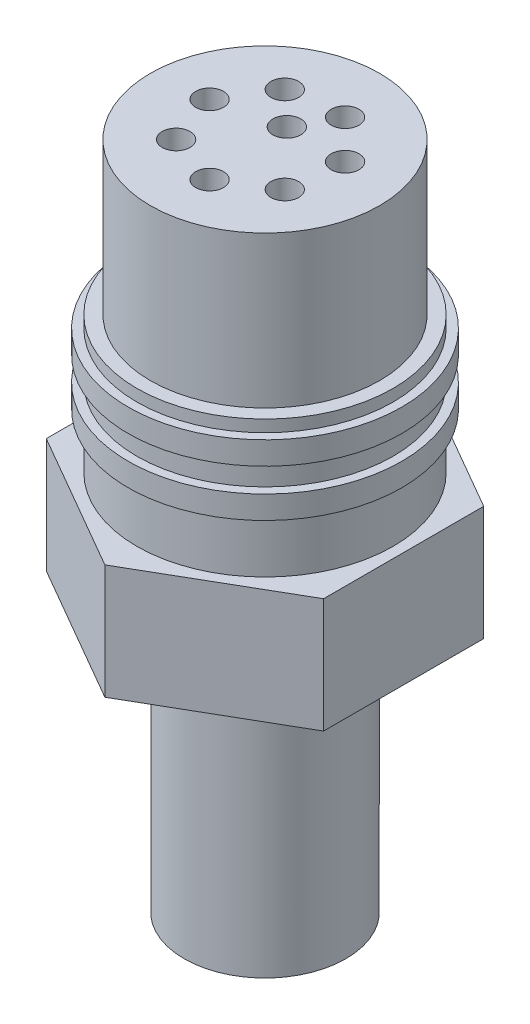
ISO-10303-21;
HEADER;
FILE_DESCRIPTION(('STEP AP214'),'2;1');
FILE_NAME('part.step','',(''),(''),'','','');
FILE_SCHEMA(('AUTOMOTIVE_DESIGN { 1 0 10303 214 1 1 1 1 }'));
ENDSEC;
DATA;
#1=APPLICATION_CONTEXT('core data for automotive mechanical design processes');
#2=APPLICATION_PROTOCOL_DEFINITION('international standard','automotive_design',2000,#1);
#3=PRODUCT_CONTEXT('',#1,'mechanical');
#4=PRODUCT('Part','Part','',(#3));
#5=PRODUCT_RELATED_PRODUCT_CATEGORY('part','',(#4));
#6=PRODUCT_DEFINITION_FORMATION('','',#4);
#7=PRODUCT_DEFINITION_CONTEXT('part definition',#1,'design');
#8=PRODUCT_DEFINITION('design','',#6,#7);
#9=PRODUCT_DEFINITION_SHAPE('','',#8);
#10=(LENGTH_UNIT() NAMED_UNIT(*) SI_UNIT(.MILLI.,.METRE.));
#11=(NAMED_UNIT(*) PLANE_ANGLE_UNIT() SI_UNIT($,.RADIAN.));
#12=(NAMED_UNIT(*) SI_UNIT($,.STERADIAN.) SOLID_ANGLE_UNIT());
#13=UNCERTAINTY_MEASURE_WITH_UNIT(LENGTH_MEASURE(1.E-05),#10,'distance_accuracy_value','');
#14=(GEOMETRIC_REPRESENTATION_CONTEXT(3) GLOBAL_UNCERTAINTY_ASSIGNED_CONTEXT((#13)) GLOBAL_UNIT_ASSIGNED_CONTEXT((#10,
#11,#12)) REPRESENTATION_CONTEXT('',''));
#15=CARTESIAN_POINT('',(0.,0.,0.));
#16=DIRECTION('',(0.,0.,1.));
#17=DIRECTION('',(1.,0.,0.));
#18=AXIS2_PLACEMENT_3D('',#15,#16,#17);
#19=CARTESIAN_POINT('',(9.52499999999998,7.874,-5.4992613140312));
#20=DIRECTION('',(-0.5,0.,0.866025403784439));
#21=DIRECTION('',(0.866025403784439,0.,0.5));
#22=AXIS2_PLACEMENT_3D('',#19,#20,#21);
#23=PLANE('',#22);
#24=DIRECTION('',(-0.866025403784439,0.,-0.5));
#25=VECTOR('',#24,1.);
#26=CARTESIAN_POINT('',(9.52499999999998,0.,-5.4992613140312));
#27=LINE('',#26,#25);
#28=CARTESIAN_POINT('',(9.52499999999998,0.,-5.4992613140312));
#29=VERTEX_POINT('',#28);
#30=CARTESIAN_POINT('',(0.,0.,-10.9985226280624));
#31=VERTEX_POINT('',#30);
#32=EDGE_CURVE('E122',#29,#31,#27,.T.);
#33=ORIENTED_EDGE('',*,*,#32,.T.);
#34=DIRECTION('',(0.,-1.,0.));
#35=VECTOR('',#34,1.);
#36=CARTESIAN_POINT('',(0.,7.874,-10.9985226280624));
#37=LINE('',#36,#35);
#38=CARTESIAN_POINT('',(0.,7.874,-10.9985226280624));
#39=VERTEX_POINT('',#38);
#40=EDGE_CURVE('E140',#39,#31,#37,.T.);
#41=ORIENTED_EDGE('',*,*,#40,.F.);
#42=DIRECTION('',(-0.866025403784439,0.,-0.5));
#43=VECTOR('',#42,1.);
#44=CARTESIAN_POINT('',(9.52499999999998,7.874,-5.4992613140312));
#45=LINE('',#44,#43);
#46=CARTESIAN_POINT('',(9.52499999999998,7.874,-5.4992613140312));
#47=VERTEX_POINT('',#46);
#48=EDGE_CURVE('E133',#47,#39,#45,.T.);
#49=ORIENTED_EDGE('',*,*,#48,.F.);
#50=DIRECTION('',(0.,-1.,0.));
#51=VECTOR('',#50,1.);
#52=CARTESIAN_POINT('',(9.52499999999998,7.874,-5.4992613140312));
#53=LINE('',#52,#51);
#54=EDGE_CURVE('E118',#47,#29,#53,.T.);
#55=ORIENTED_EDGE('',*,*,#54,.T.);
#56=EDGE_LOOP('',(#33,#41,#49,#55));
#57=FACE_BOUND('',#56,.T.);
#58=ADVANCED_FACE('F37',(#57),#23,.F.);
#59=CARTESIAN_POINT('',(0.,7.874,-10.9985226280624));
#60=DIRECTION('',(0.5,0.,0.866025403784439));
#61=DIRECTION('',(0.866025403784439,0.,-0.5));
#62=AXIS2_PLACEMENT_3D('',#59,#60,#61);
#63=PLANE('',#62);
#64=DIRECTION('',(-0.866025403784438,0.,0.5));
#65=VECTOR('',#64,1.);
#66=CARTESIAN_POINT('',(0.,0.,-10.9985226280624));
#67=LINE('',#66,#65);
#68=CARTESIAN_POINT('',(-9.52499999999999,0.,-5.49926131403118));
#69=VERTEX_POINT('',#68);
#70=EDGE_CURVE('E125',#31,#69,#67,.T.);
#71=ORIENTED_EDGE('',*,*,#70,.T.);
#72=DIRECTION('',(0.,-1.,0.));
#73=VECTOR('',#72,1.);
#74=CARTESIAN_POINT('',(-9.52499999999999,7.874,-5.49926131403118));
#75=LINE('',#74,#73);
#76=CARTESIAN_POINT('',(-9.52499999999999,7.874,-5.49926131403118));
#77=VERTEX_POINT('',#76);
#78=EDGE_CURVE('E137',#77,#69,#75,.T.);
#79=ORIENTED_EDGE('',*,*,#78,.F.);
#80=DIRECTION('',(-0.866025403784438,0.,0.5));
#81=VECTOR('',#80,1.);
#82=CARTESIAN_POINT('',(0.,7.874,-10.9985226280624));
#83=LINE('',#82,#81);
#84=EDGE_CURVE('E91',#39,#77,#83,.T.);
#85=ORIENTED_EDGE('',*,*,#84,.F.);
#86=ORIENTED_EDGE('',*,*,#40,.T.);
#87=EDGE_LOOP('',(#71,#79,#85,#86));
#88=FACE_BOUND('',#87,.T.);
#89=ADVANCED_FACE('F165',(#88),#63,.F.);
#90=CARTESIAN_POINT('',(-9.52499999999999,7.874,-5.49926131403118));
#91=DIRECTION('',(1.,0.,0.));
#92=DIRECTION('',(0.,0.,-1.));
#93=AXIS2_PLACEMENT_3D('',#90,#91,#92);
#94=PLANE('',#93);
#95=DIRECTION('',(0.,0.,1.));
#96=VECTOR('',#95,1.);
#97=CARTESIAN_POINT('',(-9.52499999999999,0.,-5.49926131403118));
#98=LINE('',#97,#96);
#99=CARTESIAN_POINT('',(-9.52499999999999,0.,5.49926131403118));
#100=VERTEX_POINT('',#99);
#101=EDGE_CURVE('E128',#69,#100,#98,.T.);
#102=ORIENTED_EDGE('',*,*,#101,.T.);
#103=DIRECTION('',(0.,-1.,0.));
#104=VECTOR('',#103,1.);
#105=CARTESIAN_POINT('',(-9.52499999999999,7.874,5.49926131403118));
#106=LINE('',#105,#104);
#107=CARTESIAN_POINT('',(-9.52499999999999,7.874,5.49926131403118));
#108=VERTEX_POINT('',#107);
#109=EDGE_CURVE('E113',#108,#100,#106,.T.);
#110=ORIENTED_EDGE('',*,*,#109,.F.);
#111=DIRECTION('',(0.,0.,1.));
#112=VECTOR('',#111,1.);
#113=CARTESIAN_POINT('',(-9.52499999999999,7.874,-5.49926131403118));
#114=LINE('',#113,#112);
#115=EDGE_CURVE('E104',#77,#108,#114,.T.);
#116=ORIENTED_EDGE('',*,*,#115,.F.);
#117=ORIENTED_EDGE('',*,*,#78,.T.);
#118=EDGE_LOOP('',(#102,#110,#116,#117));
#119=FACE_BOUND('',#118,.T.);
#120=ADVANCED_FACE('F168',(#119),#94,.F.);
#121=CARTESIAN_POINT('',(-9.52499999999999,7.874,5.49926131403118));
#122=DIRECTION('',(0.5,0.,-0.866025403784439));
#123=DIRECTION('',(-0.866025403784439,0.,-0.5));
#124=AXIS2_PLACEMENT_3D('',#121,#122,#123);
#125=PLANE('',#124);
#126=DIRECTION('',(0.866025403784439,0.,0.5));
#127=VECTOR('',#126,1.);
#128=CARTESIAN_POINT('',(-9.52499999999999,0.,5.49926131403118));
#129=LINE('',#128,#127);
#130=CARTESIAN_POINT('',(0.,0.,10.9985226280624));
#131=VERTEX_POINT('',#130);
#132=EDGE_CURVE('E112',#100,#131,#129,.T.);
#133=ORIENTED_EDGE('',*,*,#132,.T.);
#134=DIRECTION('',(0.,-1.,0.));
#135=VECTOR('',#134,1.);
#136=CARTESIAN_POINT('',(0.,7.874,10.9985226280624));
#137=LINE('',#136,#135);
#138=CARTESIAN_POINT('',(0.,7.874,10.9985226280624));
#139=VERTEX_POINT('',#138);
#140=EDGE_CURVE('E109',#139,#131,#137,.T.);
#141=ORIENTED_EDGE('',*,*,#140,.F.);
#142=DIRECTION('',(0.866025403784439,0.,0.5));
#143=VECTOR('',#142,1.);
#144=CARTESIAN_POINT('',(-9.52499999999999,7.874,5.49926131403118));
#145=LINE('',#144,#143);
#146=EDGE_CURVE('E98',#108,#139,#145,.T.);
#147=ORIENTED_EDGE('',*,*,#146,.F.);
#148=ORIENTED_EDGE('',*,*,#109,.T.);
#149=EDGE_LOOP('',(#133,#141,#147,#148));
#150=FACE_BOUND('',#149,.T.);
#151=ADVANCED_FACE('F110',(#150),#125,.F.);
#152=CARTESIAN_POINT('',(0.,7.874,10.9985226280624));
#153=DIRECTION('',(-0.5,0.,-0.866025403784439));
#154=DIRECTION('',(-0.866025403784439,0.,0.5));
#155=AXIS2_PLACEMENT_3D('',#152,#153,#154);
#156=PLANE('',#155);
#157=DIRECTION('',(0.866025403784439,0.,-0.5));
#158=VECTOR('',#157,1.);
#159=CARTESIAN_POINT('',(0.,0.,10.9985226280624));
#160=LINE('',#159,#158);
#161=CARTESIAN_POINT('',(9.52499999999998,0.,5.49926131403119));
#162=VERTEX_POINT('',#161);
#163=EDGE_CURVE('E76',#131,#162,#160,.T.);
#164=ORIENTED_EDGE('',*,*,#163,.T.);
#165=DIRECTION('',(0.,-1.,0.));
#166=VECTOR('',#165,1.);
#167=CARTESIAN_POINT('',(9.52499999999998,7.874,5.49926131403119));
#168=LINE('',#167,#166);
#169=CARTESIAN_POINT('',(9.52499999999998,7.874,5.49926131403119));
#170=VERTEX_POINT('',#169);
#171=EDGE_CURVE('E114',#170,#162,#168,.T.);
#172=ORIENTED_EDGE('',*,*,#171,.F.);
#173=DIRECTION('',(0.866025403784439,0.,-0.5));
#174=VECTOR('',#173,1.);
#175=CARTESIAN_POINT('',(0.,7.874,10.9985226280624));
#176=LINE('',#175,#174);
#177=EDGE_CURVE('E102',#139,#170,#176,.T.);
#178=ORIENTED_EDGE('',*,*,#177,.F.);
#179=ORIENTED_EDGE('',*,*,#140,.T.);
#180=EDGE_LOOP('',(#164,#172,#178,#179));
#181=FACE_BOUND('',#180,.T.);
#182=ADVANCED_FACE('F116',(#181),#156,.F.);
#183=CARTESIAN_POINT('',(9.52499999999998,7.874,5.49926131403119));
#184=DIRECTION('',(-1.,0.,0.));
#185=DIRECTION('',(0.,0.,1.));
#186=AXIS2_PLACEMENT_3D('',#183,#184,#185);
#187=PLANE('',#186);
#188=DIRECTION('',(0.,0.,-1.));
#189=VECTOR('',#188,1.);
#190=CARTESIAN_POINT('',(9.52499999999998,0.,5.49926131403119));
#191=LINE('',#190,#189);
#192=EDGE_CURVE('E82',#162,#29,#191,.T.);
#193=ORIENTED_EDGE('',*,*,#192,.T.);
#194=ORIENTED_EDGE('',*,*,#54,.F.);
#195=DIRECTION('',(0.,0.,-1.));
#196=VECTOR('',#195,1.);
#197=CARTESIAN_POINT('',(9.52499999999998,7.874,5.49926131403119));
#198=LINE('',#197,#196);
#199=EDGE_CURVE('E53',#170,#47,#198,.T.);
#200=ORIENTED_EDGE('',*,*,#199,.F.);
#201=ORIENTED_EDGE('',*,*,#171,.T.);
#202=EDGE_LOOP('',(#193,#194,#200,#201));
#203=FACE_BOUND('',#202,.T.);
#204=ADVANCED_FACE('F172',(#203),#187,.F.);
#205=CARTESIAN_POINT('',(-9.52499999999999,7.874,-16.4977839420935));
#206=DIRECTION('',(0.,1.,0.));
#207=DIRECTION('',(0.,0.,1.));
#208=AXIS2_PLACEMENT_3D('',#205,#206,#207);
#209=PLANE('',#208);
#210=CARTESIAN_POINT('',(0.,7.874,0.));
#211=DIRECTION('',(0.,1.,0.));
#212=DIRECTION('',(-1.,0.,0.));
#213=AXIS2_PLACEMENT_3D('',#210,#211,#212);
#214=CIRCLE('',#213,8.8011);
#215=CARTESIAN_POINT('',(-8.8011,7.874,0.));
#216=VERTEX_POINT('',#215);
#217=EDGE_CURVE('E574',#216,#216,#214,.T.);
#218=ORIENTED_EDGE('',*,*,#217,.F.);
#219=EDGE_LOOP('',(#218));
#220=FACE_BOUND('',#219,.T.);
#221=ORIENTED_EDGE('',*,*,#48,.T.);
#222=ORIENTED_EDGE('',*,*,#84,.T.);
#223=ORIENTED_EDGE('',*,*,#115,.T.);
#224=ORIENTED_EDGE('',*,*,#146,.T.);
#225=ORIENTED_EDGE('',*,*,#177,.T.);
#226=ORIENTED_EDGE('',*,*,#199,.T.);
#227=EDGE_LOOP('',(#221,#222,#223,#224,#225,#226));
#228=FACE_BOUND('',#227,.T.);
#229=ADVANCED_FACE('F100',(#220,#228),#209,.T.);
#230=CARTESIAN_POINT('',(-9.52499999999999,0.,-16.4977839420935));
#231=DIRECTION('',(0.,1.,0.));
#232=DIRECTION('',(0.,0.,1.));
#233=AXIS2_PLACEMENT_3D('',#230,#231,#232);
#234=PLANE('',#233);
#235=CARTESIAN_POINT('',(0.,0.,0.));
#236=DIRECTION('',(0.,1.,0.));
#237=DIRECTION('',(0.,0.,1.));
#238=AXIS2_PLACEMENT_3D('',#235,#236,#237);
#239=CIRCLE('',#238,5.55625);
#240=CARTESIAN_POINT('',(0.,0.,5.55625));
#241=VERTEX_POINT('',#240);
#242=EDGE_CURVE('E11',#241,#241,#239,.F.);
#243=ORIENTED_EDGE('',*,*,#242,.F.);
#244=EDGE_LOOP('',(#243));
#245=FACE_BOUND('',#244,.T.);
#246=ORIENTED_EDGE('',*,*,#32,.F.);
#247=ORIENTED_EDGE('',*,*,#192,.F.);
#248=ORIENTED_EDGE('',*,*,#163,.F.);
#249=ORIENTED_EDGE('',*,*,#132,.F.);
#250=ORIENTED_EDGE('',*,*,#101,.F.);
#251=ORIENTED_EDGE('',*,*,#70,.F.);
#252=EDGE_LOOP('',(#246,#247,#248,#249,#250,#251));
#253=FACE_BOUND('',#252,.T.);
#254=ADVANCED_FACE('F150',(#245,#253),#234,.F.);
#255=CARTESIAN_POINT('',(8.8011,17.272,0.));
#256=DIRECTION('',(0.,-1.,0.));
#257=DIRECTION('',(1.,0.,0.));
#258=AXIS2_PLACEMENT_3D('',#255,#256,#257);
#259=PLANE('',#258);
#260=CARTESIAN_POINT('',(0.,17.272,0.));
#261=DIRECTION('',(0.,-1.,0.));
#262=DIRECTION('',(1.,0.,0.));
#263=AXIS2_PLACEMENT_3D('',#260,#261,#262);
#264=CIRCLE('',#263,7.875);
#265=CARTESIAN_POINT('',(7.875,17.272,0.));
#266=VERTEX_POINT('',#265);
#267=EDGE_CURVE('E45',#266,#266,#264,.F.);
#268=ORIENTED_EDGE('',*,*,#267,.F.);
#269=EDGE_LOOP('',(#268));
#270=FACE_BOUND('',#269,.T.);
#271=CARTESIAN_POINT('',(0.,17.272,0.));
#272=DIRECTION('',(0.,1.,0.));
#273=DIRECTION('',(-1.,0.,0.));
#274=AXIS2_PLACEMENT_3D('',#271,#272,#273);
#275=CIRCLE('',#274,8.8011);
#276=CARTESIAN_POINT('',(-8.8011,17.272,0.));
#277=VERTEX_POINT('',#276);
#278=EDGE_CURVE('E126',#277,#277,#275,.T.);
#279=ORIENTED_EDGE('',*,*,#278,.T.);
#280=EDGE_LOOP('',(#279));
#281=FACE_BOUND('',#280,.T.);
#282=ADVANCED_FACE('F146',(#270,#281),#259,.F.);
#283=CARTESIAN_POINT('',(0.,0.,0.));
#284=DIRECTION('',(0.,1.,0.));
#285=DIRECTION('',(-1.,0.,0.));
#286=AXIS2_PLACEMENT_3D('',#283,#284,#285);
#287=CYLINDRICAL_SURFACE('',#286,8.8011);
#288=ORIENTED_EDGE('',*,*,#278,.F.);
#289=EDGE_LOOP('',(#288));
#290=FACE_BOUND('',#289,.T.);
#291=CARTESIAN_POINT('',(0.,16.4592,0.));
#292=DIRECTION('',(0.,1.,0.));
#293=DIRECTION('',(-1.,0.,0.));
#294=AXIS2_PLACEMENT_3D('',#291,#292,#293);
#295=CIRCLE('',#294,8.8011);
#296=CARTESIAN_POINT('',(-8.8011,16.4592,0.));
#297=VERTEX_POINT('',#296);
#298=EDGE_CURVE('E155',#297,#297,#295,.T.);
#299=ORIENTED_EDGE('',*,*,#298,.T.);
#300=EDGE_LOOP('',(#299));
#301=FACE_BOUND('',#300,.T.);
#302=ADVANCED_FACE('F149',(#290,#301),#287,.T.);
#303=CARTESIAN_POINT('',(9.398,16.4592,0.));
#304=DIRECTION('',(0.,-1.,0.));
#305=DIRECTION('',(1.,0.,0.));
#306=AXIS2_PLACEMENT_3D('',#303,#304,#305);
#307=PLANE('',#306);
#308=ORIENTED_EDGE('',*,*,#298,.F.);
#309=EDGE_LOOP('',(#308));
#310=FACE_BOUND('',#309,.T.);
#311=CARTESIAN_POINT('',(0.,16.4592,0.));
#312=DIRECTION('',(0.,1.,0.));
#313=DIRECTION('',(-1.,0.,0.));
#314=AXIS2_PLACEMENT_3D('',#311,#312,#313);
#315=CIRCLE('',#314,9.398);
#316=CARTESIAN_POINT('',(-9.398,16.4592,0.));
#317=VERTEX_POINT('',#316);
#318=EDGE_CURVE('E158',#317,#317,#315,.T.);
#319=ORIENTED_EDGE('',*,*,#318,.T.);
#320=EDGE_LOOP('',(#319));
#321=FACE_BOUND('',#320,.T.);
#322=ADVANCED_FACE('F222',(#310,#321),#307,.F.);
#323=CARTESIAN_POINT('',(0.,0.,0.));
#324=DIRECTION('',(0.,1.,0.));
#325=DIRECTION('',(-1.,0.,0.));
#326=AXIS2_PLACEMENT_3D('',#323,#324,#325);
#327=CYLINDRICAL_SURFACE('',#326,9.398);
#328=ORIENTED_EDGE('',*,*,#318,.F.);
#329=EDGE_LOOP('',(#328));
#330=FACE_BOUND('',#329,.T.);
#331=CARTESIAN_POINT('',(0.,14.8844,0.));
#332=DIRECTION('',(0.,1.,0.));
#333=DIRECTION('',(-1.,0.,0.));
#334=AXIS2_PLACEMENT_3D('',#331,#332,#333);
#335=CIRCLE('',#334,9.398);
#336=CARTESIAN_POINT('',(-9.398,14.8844,0.));
#337=VERTEX_POINT('',#336);
#338=EDGE_CURVE('E592',#337,#337,#335,.T.);
#339=ORIENTED_EDGE('',*,*,#338,.T.);
#340=EDGE_LOOP('',(#339));
#341=FACE_BOUND('',#340,.T.);
#342=ADVANCED_FACE('F232',(#330,#341),#327,.T.);
#343=CARTESIAN_POINT('',(8.8011,14.8844,0.));
#344=DIRECTION('',(0.,1.,0.));
#345=DIRECTION('',(-1.,0.,0.));
#346=AXIS2_PLACEMENT_3D('',#343,#344,#345);
#347=PLANE('',#346);
#348=ORIENTED_EDGE('',*,*,#338,.F.);
#349=EDGE_LOOP('',(#348));
#350=FACE_BOUND('',#349,.T.);
#351=CARTESIAN_POINT('',(0.,14.8844,0.));
#352=DIRECTION('',(0.,1.,0.));
#353=DIRECTION('',(-1.,0.,0.));
#354=AXIS2_PLACEMENT_3D('',#351,#352,#353);
#355=CIRCLE('',#354,8.8011);
#356=CARTESIAN_POINT('',(-8.8011,14.8844,0.));
#357=VERTEX_POINT('',#356);
#358=EDGE_CURVE('E589',#357,#357,#355,.T.);
#359=ORIENTED_EDGE('',*,*,#358,.T.);
#360=EDGE_LOOP('',(#359));
#361=FACE_BOUND('',#360,.T.);
#362=ADVANCED_FACE('F242',(#350,#361),#347,.F.);
#363=CARTESIAN_POINT('',(0.,0.,0.));
#364=DIRECTION('',(0.,1.,0.));
#365=DIRECTION('',(-1.,0.,0.));
#366=AXIS2_PLACEMENT_3D('',#363,#364,#365);
#367=CYLINDRICAL_SURFACE('',#366,8.8011);
#368=ORIENTED_EDGE('',*,*,#358,.F.);
#369=EDGE_LOOP('',(#368));
#370=FACE_BOUND('',#369,.T.);
#371=CARTESIAN_POINT('',(0.,13.2334,0.));
#372=DIRECTION('',(0.,1.,0.));
#373=DIRECTION('',(-1.,0.,0.));
#374=AXIS2_PLACEMENT_3D('',#371,#372,#373);
#375=CIRCLE('',#374,8.8011);
#376=CARTESIAN_POINT('',(-8.8011,13.2334,0.));
#377=VERTEX_POINT('',#376);
#378=EDGE_CURVE('E586',#377,#377,#375,.T.);
#379=ORIENTED_EDGE('',*,*,#378,.T.);
#380=EDGE_LOOP('',(#379));
#381=FACE_BOUND('',#380,.T.);
#382=ADVANCED_FACE('F252',(#370,#381),#367,.T.);
#383=CARTESIAN_POINT('',(9.398,13.2334,0.));
#384=DIRECTION('',(0.,-1.,0.));
#385=DIRECTION('',(1.,0.,0.));
#386=AXIS2_PLACEMENT_3D('',#383,#384,#385);
#387=PLANE('',#386);
#388=ORIENTED_EDGE('',*,*,#378,.F.);
#389=EDGE_LOOP('',(#388));
#390=FACE_BOUND('',#389,.T.);
#391=CARTESIAN_POINT('',(0.,13.2334,0.));
#392=DIRECTION('',(0.,1.,0.));
#393=DIRECTION('',(-1.,0.,0.));
#394=AXIS2_PLACEMENT_3D('',#391,#392,#393);
#395=CIRCLE('',#394,9.398);
#396=CARTESIAN_POINT('',(-9.398,13.2334,0.));
#397=VERTEX_POINT('',#396);
#398=EDGE_CURVE('E583',#397,#397,#395,.T.);
#399=ORIENTED_EDGE('',*,*,#398,.T.);
#400=EDGE_LOOP('',(#399));
#401=FACE_BOUND('',#400,.T.);
#402=ADVANCED_FACE('F262',(#390,#401),#387,.F.);
#403=CARTESIAN_POINT('',(0.,0.,0.));
#404=DIRECTION('',(0.,1.,0.));
#405=DIRECTION('',(-1.,0.,0.));
#406=AXIS2_PLACEMENT_3D('',#403,#404,#405);
#407=CYLINDRICAL_SURFACE('',#406,9.398);
#408=ORIENTED_EDGE('',*,*,#398,.F.);
#409=EDGE_LOOP('',(#408));
#410=FACE_BOUND('',#409,.T.);
#411=CARTESIAN_POINT('',(0.,11.6586,0.));
#412=DIRECTION('',(0.,1.,0.));
#413=DIRECTION('',(-1.,0.,0.));
#414=AXIS2_PLACEMENT_3D('',#411,#412,#413);
#415=CIRCLE('',#414,9.398);
#416=CARTESIAN_POINT('',(-9.398,11.6586,0.));
#417=VERTEX_POINT('',#416);
#418=EDGE_CURVE('E580',#417,#417,#415,.T.);
#419=ORIENTED_EDGE('',*,*,#418,.T.);
#420=EDGE_LOOP('',(#419));
#421=FACE_BOUND('',#420,.T.);
#422=ADVANCED_FACE('F272',(#410,#421),#407,.T.);
#423=CARTESIAN_POINT('',(8.80109999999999,11.6586,0.));
#424=DIRECTION('',(0.,1.,0.));
#425=DIRECTION('',(-1.,0.,0.));
#426=AXIS2_PLACEMENT_3D('',#423,#424,#425);
#427=PLANE('',#426);
#428=ORIENTED_EDGE('',*,*,#418,.F.);
#429=EDGE_LOOP('',(#428));
#430=FACE_BOUND('',#429,.T.);
#431=CARTESIAN_POINT('',(0.,11.6586,0.));
#432=DIRECTION('',(0.,1.,0.));
#433=DIRECTION('',(-1.,0.,0.));
#434=AXIS2_PLACEMENT_3D('',#431,#432,#433);
#435=CIRCLE('',#434,8.8011);
#436=CARTESIAN_POINT('',(-8.8011,11.6586,0.));
#437=VERTEX_POINT('',#436);
#438=EDGE_CURVE('E577',#437,#437,#435,.T.);
#439=ORIENTED_EDGE('',*,*,#438,.T.);
#440=EDGE_LOOP('',(#439));
#441=FACE_BOUND('',#440,.T.);
#442=ADVANCED_FACE('F282',(#430,#441),#427,.F.);
#443=CARTESIAN_POINT('',(0.,0.,0.));
#444=DIRECTION('',(0.,1.,0.));
#445=DIRECTION('',(-1.,0.,0.));
#446=AXIS2_PLACEMENT_3D('',#443,#444,#445);
#447=CYLINDRICAL_SURFACE('',#446,8.8011);
#448=ORIENTED_EDGE('',*,*,#438,.F.);
#449=EDGE_LOOP('',(#448));
#450=FACE_BOUND('',#449,.T.);
#451=ORIENTED_EDGE('',*,*,#217,.T.);
#452=EDGE_LOOP('',(#451));
#453=FACE_BOUND('',#452,.T.);
#454=ADVANCED_FACE('F292',(#450,#453),#447,.T.);
#455=CARTESIAN_POINT('',(0.,27.682,0.));
#456=DIRECTION('',(0.,-1.,0.));
#457=DIRECTION('',(1.,0.,0.));
#458=AXIS2_PLACEMENT_3D('',#455,#456,#457);
#459=CYLINDRICAL_SURFACE('',#458,7.875);
#460=CARTESIAN_POINT('',(0.,27.682,0.));
#461=DIRECTION('',(0.,1.,0.));
#462=DIRECTION('',(-1.,0.,0.));
#463=AXIS2_PLACEMENT_3D('',#460,#461,#462);
#464=CIRCLE('',#463,7.875);
#465=CARTESIAN_POINT('',(-7.875,27.682,0.));
#466=VERTEX_POINT('',#465);
#467=EDGE_CURVE('E571',#466,#466,#464,.T.);
#468=ORIENTED_EDGE('',*,*,#467,.F.);
#469=EDGE_LOOP('',(#468));
#470=FACE_BOUND('',#469,.T.);
#471=ORIENTED_EDGE('',*,*,#267,.T.);
#472=EDGE_LOOP('',(#471));
#473=FACE_BOUND('',#472,.T.);
#474=ADVANCED_FACE('F144',(#470,#473),#459,.T.);
#475=CARTESIAN_POINT('',(0.,27.682,0.));
#476=DIRECTION('',(0.,1.,0.));
#477=DIRECTION('',(-1.,0.,0.));
#478=AXIS2_PLACEMENT_3D('',#475,#476,#477);
#479=PLANE('',#478);
#480=CARTESIAN_POINT('',(0.,27.682,-1.5));
#481=DIRECTION('',(0.,1.,0.));
#482=DIRECTION('',(-1.,0.,0.));
#483=AXIS2_PLACEMENT_3D('',#480,#481,#482);
#484=CIRCLE('',#483,0.955);
#485=CARTESIAN_POINT('',(-0.955000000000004,27.682,-1.5));
#486=VERTEX_POINT('',#485);
#487=EDGE_CURVE('E521',#486,#486,#484,.T.);
#488=ORIENTED_EDGE('',*,*,#487,.F.);
#489=EDGE_LOOP('',(#488));
#490=FACE_BOUND('',#489,.T.);
#491=CARTESIAN_POINT('',(0.483462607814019,27.682,4.29084932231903));
#492=DIRECTION('',(0.,1.,0.));
#493=DIRECTION('',(-0.623489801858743,0.,0.781831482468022));
#494=AXIS2_PLACEMENT_3D('',#491,#492,#493);
#495=CIRCLE('',#494,0.955);
#496=CARTESIAN_POINT('',(-0.11197015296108,27.682,5.03749838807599));
#497=VERTEX_POINT('',#496);
#498=EDGE_CURVE('E529',#497,#497,#495,.T.);
#499=ORIENTED_EDGE('',*,*,#498,.F.);
#500=EDGE_LOOP('',(#499));
#501=FACE_BOUND('',#500,.T.);
#502=CARTESIAN_POINT('',(3.6561550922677,27.682,2.29731450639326));
#503=DIRECTION('',(0.,1.,0.));
#504=DIRECTION('',(0.222520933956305,0.,0.974927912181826));
#505=AXIS2_PLACEMENT_3D('',#502,#503,#504);
#506=CIRCLE('',#505,0.955);
#507=CARTESIAN_POINT('',(3.86866258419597,27.682,3.22837066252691));
#508=VERTEX_POINT('',#507);
#509=EDGE_CURVE('E535',#508,#508,#506,.T.);
#510=ORIENTED_EDGE('',*,*,#509,.F.);
#511=EDGE_LOOP('',(#510));
#512=FACE_BOUND('',#511,.T.);
#513=CARTESIAN_POINT('',(4.07568822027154,27.682,-1.42614498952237));
#514=DIRECTION('',(0.,1.,0.));
#515=DIRECTION('',(0.900968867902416,0.,0.433883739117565));
#516=AXIS2_PLACEMENT_3D('',#513,#514,#515);
#517=CIRCLE('',#516,0.955);
#518=CARTESIAN_POINT('',(4.93611348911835,27.682,-1.0117860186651));
#519=VERTEX_POINT('',#518);
#520=EDGE_CURVE('E541',#519,#519,#517,.T.);
#521=ORIENTED_EDGE('',*,*,#520,.F.);
#522=EDGE_LOOP('',(#521));
#523=FACE_BOUND('',#522,.T.);
#524=CARTESIAN_POINT('',(1.42614498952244,27.682,-4.07568822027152));
#525=DIRECTION('',(0.,1.,0.));
#526=DIRECTION('',(0.900968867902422,0.,-0.433883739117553));
#527=AXIS2_PLACEMENT_3D('',#524,#525,#526);
#528=CIRCLE('',#527,0.955);
#529=CARTESIAN_POINT('',(2.28657025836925,27.682,-4.49004719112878));
#530=VERTEX_POINT('',#529);
#531=EDGE_CURVE('E547',#530,#530,#528,.T.);
#532=ORIENTED_EDGE('',*,*,#531,.F.);
#533=EDGE_LOOP('',(#532));
#534=FACE_BOUND('',#533,.T.);
#535=CARTESIAN_POINT('',(-2.29731450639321,27.682,-3.65615509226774));
#536=DIRECTION('',(0.,1.,0.));
#537=DIRECTION('',(0.222520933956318,0.,-0.974927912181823));
#538=AXIS2_PLACEMENT_3D('',#535,#536,#537);
#539=CIRCLE('',#538,0.955);
#540=CARTESIAN_POINT('',(-2.08480701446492,27.682,-4.58721124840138));
#541=VERTEX_POINT('',#540);
#542=EDGE_CURVE('E553',#541,#541,#539,.T.);
#543=ORIENTED_EDGE('',*,*,#542,.F.);
#544=EDGE_LOOP('',(#543));
#545=FACE_BOUND('',#544,.T.);
#546=CARTESIAN_POINT('',(-4.29084932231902,27.682,-0.4834626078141));
#547=DIRECTION('',(0.,1.,0.));
#548=DIRECTION('',(-0.623489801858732,0.,-0.781831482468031));
#549=AXIS2_PLACEMENT_3D('',#546,#547,#548);
#550=CIRCLE('',#549,0.955);
#551=CARTESIAN_POINT('',(-4.88628208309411,27.682,-1.23011167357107));
#552=VERTEX_POINT('',#551);
#553=EDGE_CURVE('E559',#552,#552,#550,.T.);
#554=ORIENTED_EDGE('',*,*,#553,.F.);
#555=EDGE_LOOP('',(#554));
#556=FACE_BOUND('',#555,.T.);
#557=CARTESIAN_POINT('',(-3.05328708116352,27.682,3.05328708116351));
#558=DIRECTION('',(0.,1.,0.));
#559=DIRECTION('',(-1.,0.,0.));
#560=AXIS2_PLACEMENT_3D('',#557,#558,#559);
#561=CIRCLE('',#560,0.955);
#562=CARTESIAN_POINT('',(-4.00828708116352,27.682,3.05328708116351));
#563=VERTEX_POINT('',#562);
#564=EDGE_CURVE('E565',#563,#563,#561,.T.);
#565=ORIENTED_EDGE('',*,*,#564,.F.);
#566=EDGE_LOOP('',(#565));
#567=FACE_BOUND('',#566,.T.);
#568=ORIENTED_EDGE('',*,*,#467,.T.);
#569=EDGE_LOOP('',(#568));
#570=FACE_BOUND('',#569,.T.);
#571=ADVANCED_FACE('F316',(#490,#501,#512,#523,#534,#545,#556,#567,#570),#479,.T.);
#572=CARTESIAN_POINT('',(8.8011,17.272,0.));
#573=DIRECTION('',(0.,-1.,0.));
#574=DIRECTION('',(1.,0.,0.));
#575=AXIS2_PLACEMENT_3D('',#572,#573,#574);
#576=PLANE('',#575);
#577=CARTESIAN_POINT('',(-3.05328708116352,17.272,3.05328708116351));
#578=DIRECTION('',(0.,-1.,0.));
#579=DIRECTION('',(1.,0.,0.));
#580=AXIS2_PLACEMENT_3D('',#577,#578,#579);
#581=CIRCLE('',#580,0.955);
#582=CARTESIAN_POINT('',(-2.09828708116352,17.272,3.05328708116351));
#583=VERTEX_POINT('',#582);
#584=EDGE_CURVE('E568',#583,#583,#581,.F.);
#585=ORIENTED_EDGE('',*,*,#584,.T.);
#586=EDGE_LOOP('',(#585));
#587=FACE_BOUND('',#586,.T.);
#588=ADVANCED_FACE('F324',(#587),#576,.F.);
#589=CARTESIAN_POINT('',(-3.05328708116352,14.5708520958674,3.05328708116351));
#590=DIRECTION('',(0.,1.,0.));
#591=DIRECTION('',(-1.,0.,0.));
#592=AXIS2_PLACEMENT_3D('',#589,#590,#591);
#593=CYLINDRICAL_SURFACE('',#592,0.955);
#594=ORIENTED_EDGE('',*,*,#564,.T.);
#595=EDGE_LOOP('',(#594));
#596=FACE_BOUND('',#595,.T.);
#597=ORIENTED_EDGE('',*,*,#584,.F.);
#598=EDGE_LOOP('',(#597));
#599=FACE_BOUND('',#598,.T.);
#600=ADVANCED_FACE('F329',(#596,#599),#593,.F.);
#601=CARTESIAN_POINT('',(8.8011,17.272,0.));
#602=DIRECTION('',(0.,-1.,0.));
#603=DIRECTION('',(1.,0.,0.));
#604=AXIS2_PLACEMENT_3D('',#601,#602,#603);
#605=PLANE('',#604);
#606=CARTESIAN_POINT('',(-4.29084932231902,17.272,-0.4834626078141));
#607=DIRECTION('',(0.,-1.,0.));
#608=DIRECTION('',(1.,0.,0.));
#609=AXIS2_PLACEMENT_3D('',#606,#607,#608);
#610=CIRCLE('',#609,0.955);
#611=CARTESIAN_POINT('',(-3.33584932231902,17.272,-0.4834626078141));
#612=VERTEX_POINT('',#611);
#613=EDGE_CURVE('E562',#612,#612,#610,.F.);
#614=ORIENTED_EDGE('',*,*,#613,.T.);
#615=EDGE_LOOP('',(#614));
#616=FACE_BOUND('',#615,.T.);
#617=ADVANCED_FACE('F339',(#616),#605,.F.);
#618=CARTESIAN_POINT('',(-4.29084932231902,14.5708520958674,-0.4834626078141));
#619=DIRECTION('',(0.,1.,0.));
#620=DIRECTION('',(-1.,0.,0.));
#621=AXIS2_PLACEMENT_3D('',#618,#619,#620);
#622=CYLINDRICAL_SURFACE('',#621,0.955);
#623=ORIENTED_EDGE('',*,*,#553,.T.);
#624=EDGE_LOOP('',(#623));
#625=FACE_BOUND('',#624,.T.);
#626=ORIENTED_EDGE('',*,*,#613,.F.);
#627=EDGE_LOOP('',(#626));
#628=FACE_BOUND('',#627,.T.);
#629=ADVANCED_FACE('F349',(#625,#628),#622,.F.);
#630=CARTESIAN_POINT('',(8.8011,17.272,0.));
#631=DIRECTION('',(0.,-1.,0.));
#632=DIRECTION('',(1.,0.,0.));
#633=AXIS2_PLACEMENT_3D('',#630,#631,#632);
#634=PLANE('',#633);
#635=CARTESIAN_POINT('',(-2.2973145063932,17.272,-3.65615509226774));
#636=DIRECTION('',(0.,-1.,0.));
#637=DIRECTION('',(1.,0.,0.));
#638=AXIS2_PLACEMENT_3D('',#635,#636,#637);
#639=CIRCLE('',#638,0.955);
#640=CARTESIAN_POINT('',(-1.3423145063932,17.272,-3.65615509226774));
#641=VERTEX_POINT('',#640);
#642=EDGE_CURVE('E556',#641,#641,#639,.F.);
#643=ORIENTED_EDGE('',*,*,#642,.T.);
#644=EDGE_LOOP('',(#643));
#645=FACE_BOUND('',#644,.T.);
#646=ADVANCED_FACE('F359',(#645),#634,.F.);
#647=CARTESIAN_POINT('',(-2.2973145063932,14.5708520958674,-3.65615509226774));
#648=DIRECTION('',(0.,1.,0.));
#649=DIRECTION('',(-1.,0.,0.));
#650=AXIS2_PLACEMENT_3D('',#647,#648,#649);
#651=CYLINDRICAL_SURFACE('',#650,0.955);
#652=ORIENTED_EDGE('',*,*,#542,.T.);
#653=EDGE_LOOP('',(#652));
#654=FACE_BOUND('',#653,.T.);
#655=ORIENTED_EDGE('',*,*,#642,.F.);
#656=EDGE_LOOP('',(#655));
#657=FACE_BOUND('',#656,.T.);
#658=ADVANCED_FACE('F369',(#654,#657),#651,.F.);
#659=CARTESIAN_POINT('',(8.8011,17.272,0.));
#660=DIRECTION('',(0.,-1.,0.));
#661=DIRECTION('',(1.,0.,0.));
#662=AXIS2_PLACEMENT_3D('',#659,#660,#661);
#663=PLANE('',#662);
#664=CARTESIAN_POINT('',(1.42614498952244,17.272,-4.07568822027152));
#665=DIRECTION('',(0.,-1.,0.));
#666=DIRECTION('',(1.,0.,0.));
#667=AXIS2_PLACEMENT_3D('',#664,#665,#666);
#668=CIRCLE('',#667,0.955);
#669=CARTESIAN_POINT('',(2.38114498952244,17.272,-4.07568822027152));
#670=VERTEX_POINT('',#669);
#671=EDGE_CURVE('E550',#670,#670,#668,.F.);
#672=ORIENTED_EDGE('',*,*,#671,.T.);
#673=EDGE_LOOP('',(#672));
#674=FACE_BOUND('',#673,.T.);
#675=ADVANCED_FACE('F379',(#674),#663,.F.);
#676=CARTESIAN_POINT('',(1.42614498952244,14.5708520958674,-4.07568822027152));
#677=DIRECTION('',(0.,1.,0.));
#678=DIRECTION('',(-1.,0.,0.));
#679=AXIS2_PLACEMENT_3D('',#676,#677,#678);
#680=CYLINDRICAL_SURFACE('',#679,0.955);
#681=ORIENTED_EDGE('',*,*,#531,.T.);
#682=EDGE_LOOP('',(#681));
#683=FACE_BOUND('',#682,.T.);
#684=ORIENTED_EDGE('',*,*,#671,.F.);
#685=EDGE_LOOP('',(#684));
#686=FACE_BOUND('',#685,.T.);
#687=ADVANCED_FACE('F389',(#683,#686),#680,.F.);
#688=CARTESIAN_POINT('',(8.8011,17.272,0.));
#689=DIRECTION('',(0.,-1.,0.));
#690=DIRECTION('',(1.,0.,0.));
#691=AXIS2_PLACEMENT_3D('',#688,#689,#690);
#692=PLANE('',#691);
#693=CARTESIAN_POINT('',(4.07568822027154,17.272,-1.42614498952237));
#694=DIRECTION('',(0.,-1.,0.));
#695=DIRECTION('',(1.,0.,0.));
#696=AXIS2_PLACEMENT_3D('',#693,#694,#695);
#697=CIRCLE('',#696,0.955);
#698=CARTESIAN_POINT('',(5.03068822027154,17.272,-1.42614498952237));
#699=VERTEX_POINT('',#698);
#700=EDGE_CURVE('E544',#699,#699,#697,.F.);
#701=ORIENTED_EDGE('',*,*,#700,.T.);
#702=EDGE_LOOP('',(#701));
#703=FACE_BOUND('',#702,.T.);
#704=ADVANCED_FACE('F399',(#703),#692,.F.);
#705=CARTESIAN_POINT('',(4.07568822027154,14.5708520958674,-1.42614498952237));
#706=DIRECTION('',(0.,1.,0.));
#707=DIRECTION('',(-1.,0.,0.));
#708=AXIS2_PLACEMENT_3D('',#705,#706,#707);
#709=CYLINDRICAL_SURFACE('',#708,0.955);
#710=ORIENTED_EDGE('',*,*,#520,.T.);
#711=EDGE_LOOP('',(#710));
#712=FACE_BOUND('',#711,.T.);
#713=ORIENTED_EDGE('',*,*,#700,.F.);
#714=EDGE_LOOP('',(#713));
#715=FACE_BOUND('',#714,.T.);
#716=ADVANCED_FACE('F409',(#712,#715),#709,.F.);
#717=CARTESIAN_POINT('',(8.8011,17.272,0.));
#718=DIRECTION('',(0.,-1.,0.));
#719=DIRECTION('',(1.,0.,0.));
#720=AXIS2_PLACEMENT_3D('',#717,#718,#719);
#721=PLANE('',#720);
#722=CARTESIAN_POINT('',(3.6561550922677,17.272,2.29731450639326));
#723=DIRECTION('',(0.,-1.,0.));
#724=DIRECTION('',(1.,0.,0.));
#725=AXIS2_PLACEMENT_3D('',#722,#723,#724);
#726=CIRCLE('',#725,0.955);
#727=CARTESIAN_POINT('',(4.6111550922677,17.272,2.29731450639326));
#728=VERTEX_POINT('',#727);
#729=EDGE_CURVE('E538',#728,#728,#726,.F.);
#730=ORIENTED_EDGE('',*,*,#729,.T.);
#731=EDGE_LOOP('',(#730));
#732=FACE_BOUND('',#731,.T.);
#733=ADVANCED_FACE('F419',(#732),#721,.F.);
#734=CARTESIAN_POINT('',(3.6561550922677,14.5708520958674,2.29731450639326));
#735=DIRECTION('',(0.,1.,0.));
#736=DIRECTION('',(-1.,0.,0.));
#737=AXIS2_PLACEMENT_3D('',#734,#735,#736);
#738=CYLINDRICAL_SURFACE('',#737,0.955);
#739=ORIENTED_EDGE('',*,*,#509,.T.);
#740=EDGE_LOOP('',(#739));
#741=FACE_BOUND('',#740,.T.);
#742=ORIENTED_EDGE('',*,*,#729,.F.);
#743=EDGE_LOOP('',(#742));
#744=FACE_BOUND('',#743,.T.);
#745=ADVANCED_FACE('F429',(#741,#744),#738,.F.);
#746=CARTESIAN_POINT('',(8.8011,17.272,0.));
#747=DIRECTION('',(0.,-1.,0.));
#748=DIRECTION('',(1.,0.,0.));
#749=AXIS2_PLACEMENT_3D('',#746,#747,#748);
#750=PLANE('',#749);
#751=CARTESIAN_POINT('',(0.483462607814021,17.272,4.29084932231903));
#752=DIRECTION('',(0.,-1.,0.));
#753=DIRECTION('',(1.,0.,0.));
#754=AXIS2_PLACEMENT_3D('',#751,#752,#753);
#755=CIRCLE('',#754,0.955);
#756=CARTESIAN_POINT('',(1.43846260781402,17.272,4.29084932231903));
#757=VERTEX_POINT('',#756);
#758=EDGE_CURVE('E532',#757,#757,#755,.F.);
#759=ORIENTED_EDGE('',*,*,#758,.T.);
#760=EDGE_LOOP('',(#759));
#761=FACE_BOUND('',#760,.T.);
#762=ADVANCED_FACE('F439',(#761),#750,.F.);
#763=CARTESIAN_POINT('',(0.483462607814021,14.5708520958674,4.29084932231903));
#764=DIRECTION('',(0.,1.,0.));
#765=DIRECTION('',(-1.,0.,0.));
#766=AXIS2_PLACEMENT_3D('',#763,#764,#765);
#767=CYLINDRICAL_SURFACE('',#766,0.955);
#768=ORIENTED_EDGE('',*,*,#498,.T.);
#769=EDGE_LOOP('',(#768));
#770=FACE_BOUND('',#769,.T.);
#771=ORIENTED_EDGE('',*,*,#758,.F.);
#772=EDGE_LOOP('',(#771));
#773=FACE_BOUND('',#772,.T.);
#774=ADVANCED_FACE('F449',(#770,#773),#767,.F.);
#775=CARTESIAN_POINT('',(8.8011,17.272,0.));
#776=DIRECTION('',(0.,-1.,0.));
#777=DIRECTION('',(1.,0.,0.));
#778=AXIS2_PLACEMENT_3D('',#775,#776,#777);
#779=PLANE('',#778);
#780=CARTESIAN_POINT('',(0.,17.272,-1.5));
#781=DIRECTION('',(0.,-1.,0.));
#782=DIRECTION('',(1.,0.,0.));
#783=AXIS2_PLACEMENT_3D('',#780,#781,#782);
#784=CIRCLE('',#783,0.955);
#785=CARTESIAN_POINT('',(0.954999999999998,17.272,-1.5));
#786=VERTEX_POINT('',#785);
#787=EDGE_CURVE('E524',#786,#786,#784,.F.);
#788=ORIENTED_EDGE('',*,*,#787,.T.);
#789=EDGE_LOOP('',(#788));
#790=FACE_BOUND('',#789,.T.);
#791=ADVANCED_FACE('F459',(#790),#779,.F.);
#792=CARTESIAN_POINT('',(0.,14.5708520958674,-1.5));
#793=DIRECTION('',(0.,1.,0.));
#794=DIRECTION('',(-1.,0.,0.));
#795=AXIS2_PLACEMENT_3D('',#792,#793,#794);
#796=CYLINDRICAL_SURFACE('',#795,0.955);
#797=ORIENTED_EDGE('',*,*,#487,.T.);
#798=EDGE_LOOP('',(#797));
#799=FACE_BOUND('',#798,.T.);
#800=ORIENTED_EDGE('',*,*,#787,.F.);
#801=EDGE_LOOP('',(#800));
#802=FACE_BOUND('',#801,.T.);
#803=ADVANCED_FACE('F476',(#799,#802),#796,.F.);
#804=CARTESIAN_POINT('',(0.,-18.280303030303,0.));
#805=DIRECTION('',(0.,1.,0.));
#806=DIRECTION('',(0.,0.,1.));
#807=AXIS2_PLACEMENT_3D('',#804,#805,#806);
#808=CYLINDRICAL_SURFACE('',#807,5.55625);
#809=CARTESIAN_POINT('',(0.,-18.280303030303,0.));
#810=DIRECTION('',(0.,-1.,0.));
#811=DIRECTION('',(0.,0.,-1.));
#812=AXIS2_PLACEMENT_3D('',#809,#810,#811);
#813=CIRCLE('',#812,5.55625);
#814=CARTESIAN_POINT('',(0.,-18.280303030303,-5.55625));
#815=VERTEX_POINT('',#814);
#816=EDGE_CURVE('E520',#815,#815,#813,.T.);
#817=ORIENTED_EDGE('',*,*,#816,.F.);
#818=EDGE_LOOP('',(#817));
#819=FACE_BOUND('',#818,.T.);
#820=ORIENTED_EDGE('',*,*,#242,.T.);
#821=EDGE_LOOP('',(#820));
#822=FACE_BOUND('',#821,.T.);
#823=ADVANCED_FACE('F486',(#819,#822),#808,.T.);
#824=CARTESIAN_POINT('',(0.,-18.280303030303,0.));
#825=DIRECTION('',(0.,-1.,0.));
#826=DIRECTION('',(0.,0.,-1.));
#827=AXIS2_PLACEMENT_3D('',#824,#825,#826);
#828=PLANE('',#827);
#829=ORIENTED_EDGE('',*,*,#816,.T.);
#830=EDGE_LOOP('',(#829));
#831=FACE_BOUND('',#830,.T.);
#832=ADVANCED_FACE('F503',(#831),#828,.T.);
#833=CLOSED_SHELL('',(#58,#89,#120,#151,#182,#204,#229,#254,#282,#302,#322,#342,#362,#382,#402,
#422,#442,#454,#474,#571,#588,#600,#617,#629,#646,#658,#675,#687,#704,#716,#733,#745,#762,#774,
#791,#803,#823,#832));
#834=MANIFOLD_SOLID_BREP('B2',#833);
#835=ADVANCED_BREP_SHAPE_REPRESENTATION('',(#18,#834),#14);
#836=SHAPE_DEFINITION_REPRESENTATION(#9,#835);
ENDSEC;
END-ISO-10303-21;
